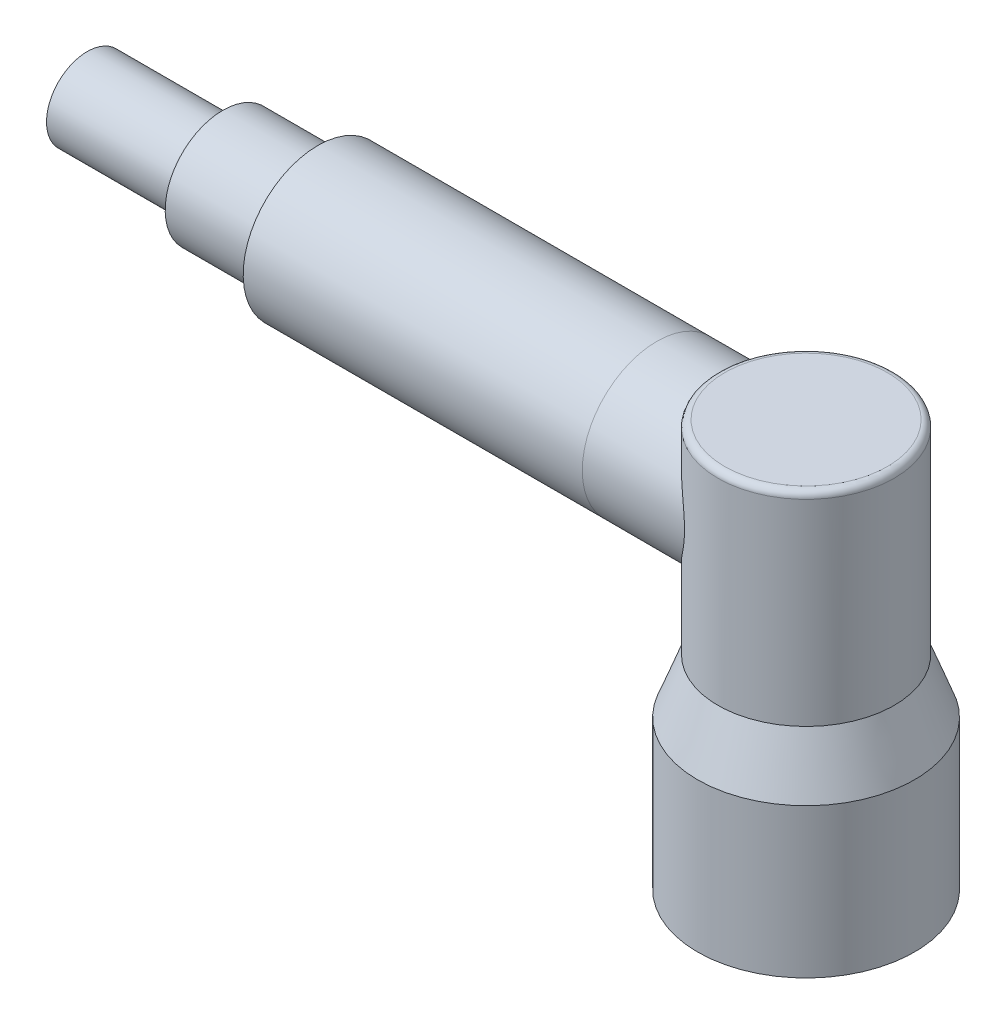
ISO-10303-21;
HEADER;
FILE_DESCRIPTION(('STEP AP214'),'2;1');
FILE_NAME('part.step','',(''),(''),'','','');
FILE_SCHEMA(('AUTOMOTIVE_DESIGN { 1 0 10303 214 1 1 1 1 }'));
ENDSEC;
DATA;
#1=APPLICATION_CONTEXT('core data for automotive mechanical design processes');
#2=APPLICATION_PROTOCOL_DEFINITION('international standard','automotive_design',2000,#1);
#3=PRODUCT_CONTEXT('',#1,'mechanical');
#4=PRODUCT('Part','Part','',(#3));
#5=PRODUCT_RELATED_PRODUCT_CATEGORY('part','',(#4));
#6=PRODUCT_DEFINITION_FORMATION('','',#4);
#7=PRODUCT_DEFINITION_CONTEXT('part definition',#1,'design');
#8=PRODUCT_DEFINITION('design','',#6,#7);
#9=PRODUCT_DEFINITION_SHAPE('','',#8);
#10=(LENGTH_UNIT() NAMED_UNIT(*) SI_UNIT(.MILLI.,.METRE.));
#11=(NAMED_UNIT(*) PLANE_ANGLE_UNIT() SI_UNIT($,.RADIAN.));
#12=(NAMED_UNIT(*) SI_UNIT($,.STERADIAN.) SOLID_ANGLE_UNIT());
#13=UNCERTAINTY_MEASURE_WITH_UNIT(LENGTH_MEASURE(1.E-05),#10,'distance_accuracy_value','');
#14=(GEOMETRIC_REPRESENTATION_CONTEXT(3) GLOBAL_UNCERTAINTY_ASSIGNED_CONTEXT((#13)) GLOBAL_UNIT_ASSIGNED_CONTEXT((#10,
#11,#12)) REPRESENTATION_CONTEXT('',''));
#15=CARTESIAN_POINT('',(0.,0.,0.));
#16=DIRECTION('',(0.,0.,1.));
#17=DIRECTION('',(1.,0.,0.));
#18=AXIS2_PLACEMENT_3D('',#15,#16,#17);
#19=CARTESIAN_POINT('',(-43.,24.,0.));
#20=DIRECTION('',(-1.,0.,0.));
#21=DIRECTION('',(0.,-1.,0.));
#22=AXIS2_PLACEMENT_3D('',#19,#20,#21);
#23=PLANE('',#22);
#24=CARTESIAN_POINT('',(-43.,24.,0.));
#25=DIRECTION('',(1.,0.,0.));
#26=DIRECTION('',(0.,1.,0.));
#27=AXIS2_PLACEMENT_3D('',#24,#25,#26);
#28=CIRCLE('',#27,4.25);
#29=CARTESIAN_POINT('',(-43.,28.25,0.));
#30=VERTEX_POINT('',#29);
#31=EDGE_CURVE('E116',#30,#30,#28,.T.);
#32=ORIENTED_EDGE('',*,*,#31,.F.);
#33=EDGE_LOOP('',(#32));
#34=FACE_BOUND('',#33,.T.);
#35=CARTESIAN_POINT('',(-43.,24.,0.));
#36=DIRECTION('',(-1.,0.,0.));
#37=DIRECTION('',(0.,-1.,0.));
#38=AXIS2_PLACEMENT_3D('',#35,#36,#37);
#39=CIRCLE('',#38,3.);
#40=CARTESIAN_POINT('',(-43.,21.,0.));
#41=VERTEX_POINT('',#40);
#42=EDGE_CURVE('E140',#41,#41,#39,.T.);
#43=ORIENTED_EDGE('',*,*,#42,.F.);
#44=EDGE_LOOP('',(#43));
#45=FACE_BOUND('',#44,.T.);
#46=ADVANCED_FACE('F38',(#34,#45),#23,.T.);
#47=CARTESIAN_POINT('',(0.,24.,0.));
#48=DIRECTION('',(1.,0.,0.));
#49=DIRECTION('',(0.,1.,0.));
#50=AXIS2_PLACEMENT_3D('',#47,#48,#49);
#51=CYLINDRICAL_SURFACE('',#50,5.5);
#52=CARTESIAN_POINT('',(-36.,24.,0.));
#53=DIRECTION('',(1.,0.,0.));
#54=DIRECTION('',(0.,1.,0.));
#55=AXIS2_PLACEMENT_3D('',#52,#53,#54);
#56=CIRCLE('',#55,5.5);
#57=CARTESIAN_POINT('',(-36.,29.5,0.));
#58=VERTEX_POINT('',#57);
#59=EDGE_CURVE('E124',#58,#58,#56,.T.);
#60=ORIENTED_EDGE('',*,*,#59,.T.);
#61=EDGE_LOOP('',(#60));
#62=FACE_BOUND('',#61,.T.);
#63=CARTESIAN_POINT('',(-11.,24.,0.));
#64=DIRECTION('',(1.,0.,0.));
#65=DIRECTION('',(0.,0.,-1.));
#66=AXIS2_PLACEMENT_3D('',#63,#64,#65);
#67=CIRCLE('',#66,5.5);
#68=CARTESIAN_POINT('',(-11.,29.5,0.));
#69=VERTEX_POINT('',#68);
#70=CARTESIAN_POINT('',(-11.,18.5,0.));
#71=VERTEX_POINT('',#70);
#72=EDGE_CURVE('E42',#69,#71,#67,.F.);
#73=ORIENTED_EDGE('',*,*,#72,.T.);
#74=EDGE_CURVE('E11',#71,#69,#67,.F.);
#75=ORIENTED_EDGE('',*,*,#74,.T.);
#76=EDGE_LOOP('',(#73,#75));
#77=FACE_BOUND('',#76,.T.);
#78=ADVANCED_FACE('F85',(#62,#77),#51,.T.);
#79=CARTESIAN_POINT('',(8.,0.,0.));
#80=DIRECTION('',(0.,-1.,0.));
#81=DIRECTION('',(0.,0.,-1.));
#82=AXIS2_PLACEMENT_3D('',#79,#80,#81);
#83=PLANE('',#82);
#84=CARTESIAN_POINT('',(0.,0.,0.));
#85=DIRECTION('',(0.,-1.,0.));
#86=DIRECTION('',(0.,0.,-1.));
#87=AXIS2_PLACEMENT_3D('',#84,#85,#86);
#88=CIRCLE('',#87,7.);
#89=CARTESIAN_POINT('',(0.,0.,-7.));
#90=VERTEX_POINT('',#89);
#91=EDGE_CURVE('E128',#90,#90,#88,.T.);
#92=ORIENTED_EDGE('',*,*,#91,.F.);
#93=EDGE_LOOP('',(#92));
#94=FACE_BOUND('',#93,.T.);
#95=CARTESIAN_POINT('',(0.,0.,0.));
#96=DIRECTION('',(0.,-1.,0.));
#97=DIRECTION('',(0.,0.,-1.));
#98=AXIS2_PLACEMENT_3D('',#95,#96,#97);
#99=CIRCLE('',#98,8.);
#100=CARTESIAN_POINT('',(0.,0.,-8.));
#101=VERTEX_POINT('',#100);
#102=EDGE_CURVE('E114',#101,#101,#99,.T.);
#103=ORIENTED_EDGE('',*,*,#102,.T.);
#104=EDGE_LOOP('',(#103));
#105=FACE_BOUND('',#104,.T.);
#106=ADVANCED_FACE('F179',(#94,#105),#83,.T.);
#107=CARTESIAN_POINT('',(0.,30.,0.));
#108=DIRECTION('',(0.,1.,0.));
#109=DIRECTION('',(0.,0.,1.));
#110=AXIS2_PLACEMENT_3D('',#107,#108,#109);
#111=PLANE('',#110);
#112=CARTESIAN_POINT('',(0.,30.,0.));
#113=DIRECTION('',(0.,1.,0.));
#114=DIRECTION('',(0.,0.,1.));
#115=AXIS2_PLACEMENT_3D('',#112,#113,#114);
#116=CIRCLE('',#115,6.);
#117=CARTESIAN_POINT('',(0.,30.,6.));
#118=VERTEX_POINT('',#117);
#119=EDGE_CURVE('E63',#118,#118,#116,.T.);
#120=ORIENTED_EDGE('',*,*,#119,.T.);
#121=EDGE_LOOP('',(#120));
#122=FACE_BOUND('',#121,.T.);
#123=ADVANCED_FACE('F107',(#122),#111,.T.);
#124=CARTESIAN_POINT('',(0.,0.,0.));
#125=DIRECTION('',(0.,-1.,0.));
#126=DIRECTION('',(0.,0.,-1.));
#127=AXIS2_PLACEMENT_3D('',#124,#125,#126);
#128=CYLINDRICAL_SURFACE('',#127,6.5);
#129=CARTESIAN_POINT('',(-6.5,29.5,0.));
#130=CARTESIAN_POINT('',(-6.4999993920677,29.4999993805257,-0.129940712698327));
#131=CARTESIAN_POINT('',(-6.49609529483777,29.4953870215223,-0.259890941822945));
#132=CARTESIAN_POINT('',(-6.48056633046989,29.4770214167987,-0.518731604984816));
#133=CARTESIAN_POINT('',(-6.46893780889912,29.4632638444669,-0.647621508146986));
#134=CARTESIAN_POINT('',(-6.43820267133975,29.4268360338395,-0.903418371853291));
#135=CARTESIAN_POINT('',(-6.41908523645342,29.4041529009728,-1.03032218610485));
#136=CARTESIAN_POINT('',(-6.3737826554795,29.3502633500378,-1.2810694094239));
#137=CARTESIAN_POINT('',(-6.34759424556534,29.3190529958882,-1.4049113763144));
#138=CARTESIAN_POINT('',(-6.28889240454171,29.2488604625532,-1.64782608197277));
#139=CARTESIAN_POINT('',(-6.25642515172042,29.2099349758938,-1.76692641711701));
#140=CARTESIAN_POINT('',(-6.185643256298,29.1247186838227,-2.00069003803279));
#141=CARTESIAN_POINT('',(-6.14732605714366,29.0784246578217,-2.11535135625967));
#142=CARTESIAN_POINT('',(-6.02456149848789,28.9293558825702,-2.45184268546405));
#143=CARTESIAN_POINT('',(-5.93224404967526,28.8163268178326,-2.66640897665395));
#144=CARTESIAN_POINT('',(-5.76331243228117,28.6063367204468,-3.00975854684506));
#145=CARTESIAN_POINT('',(-5.69079698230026,28.5153802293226,-3.14440606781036));
#146=CARTESIAN_POINT('',(-5.5399558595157,28.3237265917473,-3.40312710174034));
#147=CARTESIAN_POINT('',(-5.46163020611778,28.223029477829,-3.52720065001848));
#148=CARTESIAN_POINT('',(-5.30055187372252,28.0125374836,-3.76494835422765));
#149=CARTESIAN_POINT('',(-5.21778791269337,27.9027189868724,-3.87859380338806));
#150=CARTESIAN_POINT('',(-5.04962413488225,27.6748630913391,-4.09512865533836));
#151=CARTESIAN_POINT('',(-4.96422466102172,27.5568267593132,-4.19801944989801));
#152=CARTESIAN_POINT('',(-4.79079104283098,27.3105114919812,-4.39498205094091));
#153=CARTESIAN_POINT('',(-4.70273792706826,27.1820782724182,-4.48884404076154));
#154=CARTESIAN_POINT('',(-4.52761122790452,26.9170483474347,-4.6654256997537));
#155=CARTESIAN_POINT('',(-4.44053798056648,26.7804489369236,-4.74814164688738));
#156=CARTESIAN_POINT('',(-4.27006163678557,26.499186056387,-4.90201143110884));
#157=CARTESIAN_POINT('',(-4.1866507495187,26.3545413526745,-4.97319077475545));
#158=CARTESIAN_POINT('',(-4.02659319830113,26.0565102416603,-5.10364522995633));
#159=CARTESIAN_POINT('',(-3.94994093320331,25.9031312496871,-5.16293025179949));
#160=CARTESIAN_POINT('',(-3.80248138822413,25.5753981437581,-5.27258537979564));
#161=CARTESIAN_POINT('',(-3.73251141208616,25.4003303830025,-5.32198656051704));
#162=CARTESIAN_POINT('',(-3.61279207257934,25.0396459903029,-5.40398734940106));
#163=CARTESIAN_POINT('',(-3.56299681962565,24.8540544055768,-5.43662513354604));
#164=CARTESIAN_POINT('',(-3.50918500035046,24.5686304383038,-5.47138637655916));
#165=CARTESIAN_POINT('',(-3.49470068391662,24.4715811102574,-5.48062159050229));
#166=CARTESIAN_POINT('',(-3.47374612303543,24.2762496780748,-5.49392847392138));
#167=CARTESIAN_POINT('',(-3.46727493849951,24.1779677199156,-5.49800074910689));
#168=CARTESIAN_POINT('',(-3.46275592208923,23.9811791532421,-5.50084793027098));
#169=CARTESIAN_POINT('',(-3.46470415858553,23.8826726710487,-5.49962530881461));
#170=CARTESIAN_POINT('',(-3.47688890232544,23.6863816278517,-5.49192989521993));
#171=CARTESIAN_POINT('',(-3.48712625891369,23.5885971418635,-5.48545656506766));
#172=CARTESIAN_POINT('',(-3.51593822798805,23.3901623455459,-5.46703575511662));
#173=CARTESIAN_POINT('',(-3.53487498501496,23.2895873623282,-5.45484996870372));
#174=CARTESIAN_POINT('',(-3.58010541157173,23.0908614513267,-5.42527199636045));
#175=CARTESIAN_POINT('',(-3.60640408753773,22.9927122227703,-5.40787626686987));
#176=CARTESIAN_POINT('',(-3.69464274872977,22.7021012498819,-5.34832845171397));
#177=CARTESIAN_POINT('',(-3.76585272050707,22.5139120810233,-5.29885876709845));
#178=CARTESIAN_POINT('',(-3.90868928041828,22.1846422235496,-5.19407887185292));
#179=CARTESIAN_POINT('',(-3.97767056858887,22.0414005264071,-5.14166014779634));
#180=CARTESIAN_POINT('',(-4.12219061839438,21.7624403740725,-5.02653776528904));
#181=CARTESIAN_POINT('',(-4.19773353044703,21.6267267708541,-4.96382757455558));
#182=CARTESIAN_POINT('',(-4.35266497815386,21.3623536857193,-4.8285513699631));
#183=CARTESIAN_POINT('',(-4.43205875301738,21.2337043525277,-4.75597167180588));
#184=CARTESIAN_POINT('',(-4.59245977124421,20.9833954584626,-4.60127500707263));
#185=CARTESIAN_POINT('',(-4.67346666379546,20.8617343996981,-4.51916009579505));
#186=CARTESIAN_POINT('',(-4.84071870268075,20.6175482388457,-4.33975279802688));
#187=CARTESIAN_POINT('',(-4.92695861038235,20.4954907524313,-4.24181792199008));
#188=CARTESIAN_POINT('',(-5.09758028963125,20.2594157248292,-4.03517548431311));
#189=CARTESIAN_POINT('',(-5.18196179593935,20.1453993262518,-3.92646639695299));
#190=CARTESIAN_POINT('',(-5.34708488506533,19.9261188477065,-3.69843859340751));
#191=CARTESIAN_POINT('',(-5.42783274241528,19.8208393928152,-3.5791393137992));
#192=CARTESIAN_POINT('',(-5.58424296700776,19.6196155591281,-3.32985399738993));
#193=CARTESIAN_POINT('',(-5.65990511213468,19.5236715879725,-3.199867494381));
#194=CARTESIAN_POINT('',(-5.84664097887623,19.2892916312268,-2.85052138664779));
#195=CARTESIAN_POINT('',(-5.95276771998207,19.158529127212,-2.62309150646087));
#196=CARTESIAN_POINT('',(-6.09433822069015,18.9858178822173,-2.26399630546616));
#197=CARTESIAN_POINT('',(-6.13860329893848,18.9321392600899,-2.14126338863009));
#198=CARTESIAN_POINT('',(-6.22046651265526,18.8332817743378,-1.89028636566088));
#199=CARTESIAN_POINT('',(-6.25806756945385,18.7880991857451,-1.76204470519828));
#200=CARTESIAN_POINT('',(-6.3261279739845,18.7065699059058,-1.49955369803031));
#201=CARTESIAN_POINT('',(-6.35651844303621,18.6703083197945,-1.36525993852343));
#202=CARTESIAN_POINT('',(-6.40898986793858,18.6078353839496,-1.09274688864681));
#203=CARTESIAN_POINT('',(-6.43107077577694,18.5816240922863,-0.954527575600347));
#204=CARTESIAN_POINT('',(-6.46633536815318,18.5398151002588,-0.675476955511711));
#205=CARTESIAN_POINT('',(-6.47952598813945,18.5242091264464,-0.534647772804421));
#206=CARTESIAN_POINT('',(-6.49667266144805,18.5039299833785,-0.251652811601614));
#207=CARTESIAN_POINT('',(-6.50063005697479,18.4992552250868,-0.109487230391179));
#208=CARTESIAN_POINT('',(-6.49930482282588,18.5008217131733,0.155048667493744));
#209=CARTESIAN_POINT('',(-6.49522453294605,18.5056425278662,0.277437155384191));
#210=CARTESIAN_POINT('',(-6.4802180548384,18.5233907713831,0.521242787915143));
#211=CARTESIAN_POINT('',(-6.46928965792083,18.5363208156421,0.642659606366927));
#212=CARTESIAN_POINT('',(-6.44080985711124,18.5700723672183,0.883554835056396));
#213=CARTESIAN_POINT('',(-6.42326096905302,18.5908908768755,1.00303396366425));
#214=CARTESIAN_POINT('',(-6.38188572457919,18.6400895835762,1.23933491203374));
#215=CARTESIAN_POINT('',(-6.3580569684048,18.6684726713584,1.35615569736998));
#216=CARTESIAN_POINT('',(-6.27839849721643,18.7636363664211,1.69886877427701));
#217=CARTESIAN_POINT('',(-6.2140274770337,18.8408641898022,1.91999215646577));
#218=CARTESIAN_POINT('',(-6.06635918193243,19.0197129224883,2.34522807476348));
#219=CARTESIAN_POINT('',(-5.98305423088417,19.1213437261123,2.549333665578));
#220=CARTESIAN_POINT('',(-5.82729154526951,19.3138971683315,2.88383762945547));
#221=CARTESIAN_POINT('',(-5.75835878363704,19.3998101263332,3.01883682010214));
#222=CARTESIAN_POINT('',(-5.61443917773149,19.5812911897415,3.27873942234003));
#223=CARTESIAN_POINT('',(-5.53945209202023,19.6768596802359,3.40364243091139));
#224=CARTESIAN_POINT('',(-5.38474190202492,19.8769568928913,3.64348363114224));
#225=CARTESIAN_POINT('',(-5.3050077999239,19.9815066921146,3.75839703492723));
#226=CARTESIAN_POINT('',(-5.14246202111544,20.1986706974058,3.97790533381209));
#227=CARTESIAN_POINT('',(-5.05965072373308,20.3112839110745,4.0825014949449));
#228=CARTESIAN_POINT('',(-4.89093081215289,20.5463022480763,4.28325804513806));
#229=CARTESIAN_POINT('',(-4.80499324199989,20.6688496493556,4.37922729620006));
#230=CARTESIAN_POINT('',(-4.6332635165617,20.9217283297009,4.56053273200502));
#231=CARTESIAN_POINT('',(-4.54747140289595,21.0520615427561,4.64586625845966));
#232=CARTESIAN_POINT('',(-4.37829066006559,21.3203965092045,4.8056294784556));
#233=CARTESIAN_POINT('',(-4.2948984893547,21.4583859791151,4.88007597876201));
#234=CARTESIAN_POINT('',(-4.13311144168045,21.7425150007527,5.01783534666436));
#235=CARTESIAN_POINT('',(-4.05471355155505,21.8886495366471,5.08115496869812));
#236=CARTESIAN_POINT('',(-3.89502086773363,22.2127994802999,5.2048509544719));
#237=CARTESIAN_POINT('',(-3.8151222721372,22.3922692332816,5.26329029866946));
#238=CARTESIAN_POINT('',(-3.67433685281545,22.7630868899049,5.36252740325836));
#239=CARTESIAN_POINT('',(-3.61340975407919,22.9544085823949,5.40336260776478));
#240=CARTESIAN_POINT('',(-3.5272781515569,23.3163231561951,5.45990724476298));
#241=CARTESIAN_POINT('',(-3.49795922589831,23.4854360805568,5.47856063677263));
#242=CARTESIAN_POINT('',(-3.46427144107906,23.8270639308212,5.4999339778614));
#243=CARTESIAN_POINT('',(-3.45987042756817,23.9995741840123,5.50267446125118));
#244=CARTESIAN_POINT('',(-3.47677765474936,24.3426049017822,5.49200213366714));
#245=CARTESIAN_POINT('',(-3.49806647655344,24.5131267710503,5.47860152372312));
#246=CARTESIAN_POINT('',(-3.56261013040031,24.8481795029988,5.43683917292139));
#247=CARTESIAN_POINT('',(-3.60590551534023,25.0126987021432,5.40844980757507));
#248=CARTESIAN_POINT('',(-3.69802536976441,25.2999584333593,5.34574788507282));
#249=CARTESIAN_POINT('',(-3.74381931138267,25.4242628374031,5.3139011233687));
#250=CARTESIAN_POINT('',(-3.84299258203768,25.6676159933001,5.24262696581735));
#251=CARTESIAN_POINT('',(-3.89637660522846,25.7866614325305,5.20319487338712));
#252=CARTESIAN_POINT('',(-4.0086856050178,26.0199129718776,5.11717292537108));
#253=CARTESIAN_POINT('',(-4.06762793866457,26.1341021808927,5.07056033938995));
#254=CARTESIAN_POINT('',(-4.18913862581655,26.3574670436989,4.97064506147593));
#255=CARTESIAN_POINT('',(-4.25170666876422,26.4666431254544,4.91734294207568));
#256=CARTESIAN_POINT('',(-4.40816197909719,26.7290172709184,4.77843814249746));
#257=CARTESIAN_POINT('',(-4.50330499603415,26.8795539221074,4.68919976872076));
#258=CARTESIAN_POINT('',(-4.69497744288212,27.1709336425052,4.4972903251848));
#259=CARTESIAN_POINT('',(-4.79150746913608,27.311772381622,4.39461331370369));
#260=CARTESIAN_POINT('',(-4.98317305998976,27.5834708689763,4.17601213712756));
#261=CARTESIAN_POINT('',(-5.07831018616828,27.7143426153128,4.06010433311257));
#262=CARTESIAN_POINT('',(-5.26492227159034,27.9656611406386,3.81501739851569));
#263=CARTESIAN_POINT('',(-5.35639872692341,28.0861122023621,3.68584376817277));
#264=CARTESIAN_POINT('',(-5.58142679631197,28.3777886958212,3.34064219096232));
#265=CARTESIAN_POINT('',(-5.71108451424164,28.541392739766,3.11532424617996));
#266=CARTESIAN_POINT('',(-5.88893642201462,28.7625039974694,2.75471455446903));
#267=CARTESIAN_POINT('',(-5.9454423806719,28.8321519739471,2.63075481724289));
#268=CARTESIAN_POINT('',(-6.05193197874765,28.962591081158,2.37554206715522));
#269=CARTESIAN_POINT('',(-6.10191695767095,29.0233840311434,2.24429056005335));
#270=CARTESIAN_POINT('',(-6.18642031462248,29.1256682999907,1.99803767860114));
#271=CARTESIAN_POINT('',(-6.22212315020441,29.1686837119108,1.88407246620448));
#272=CARTESIAN_POINT('',(-6.28770960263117,29.2474535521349,1.65203902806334));
#273=CARTESIAN_POINT('',(-6.31759440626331,29.2832094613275,1.53397164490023));
#274=CARTESIAN_POINT('',(-6.37095779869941,29.3469061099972,1.29456914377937));
#275=CARTESIAN_POINT('',(-6.39444816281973,29.3748612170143,1.17324049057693));
#276=CARTESIAN_POINT('',(-6.43462522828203,29.4225979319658,0.927920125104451));
#277=CARTESIAN_POINT('',(-6.45131484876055,29.4423830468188,0.803929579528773));
#278=CARTESIAN_POINT('',(-6.47621802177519,29.471878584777,0.566857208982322));
#279=CARTESIAN_POINT('',(-6.4851212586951,29.4824093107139,0.453949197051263));
#280=CARTESIAN_POINT('',(-6.49701312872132,29.4964710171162,0.227363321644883));
#281=CARTESIAN_POINT('',(-6.50000053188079,29.5000005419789,0.113685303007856));
#282=CARTESIAN_POINT('',(-6.5,29.5,0.));
#283=B_SPLINE_CURVE_WITH_KNOTS('',3,(#129,#130,#131,#132,#133,#134,#135,#136,#137,#138,#139,
#140,#141,#142,#143,#144,#145,#146,#147,#148,#149,#150,#151,#152,#153,#154,#155,#156,#157,#158,
#159,#160,#161,#162,#163,#164,#165,#166,#167,#168,#169,#170,#171,#172,#173,#174,#175,#176,#177,
#178,#179,#180,#181,#182,#183,#184,#185,#186,#187,#188,#189,#190,#191,#192,#193,#194,#195,#196,
#197,#198,#199,#200,#201,#202,#203,#204,#205,#206,#207,#208,#209,#210,#211,#212,#213,#214,#215,
#216,#217,#218,#219,#220,#221,#222,#223,#224,#225,#226,#227,#228,#229,#230,#231,#232,#233,#234,
#235,#236,#237,#238,#239,#240,#241,#242,#243,#244,#245,#246,#247,#248,#249,#250,#251,#252,#253,
#254,#255,#256,#257,#258,#259,#260,#261,#262,#263,#264,#265,#266,#267,#268,#269,#270,#271,#272,
#273,#274,#275,#276,#277,#278,#279,#280,#281,#282),.UNSPECIFIED.,.T.,.F.,(4,2,2,2,2,2,2,2,2,2,2,
2,2,2,2,2,2,2,2,2,2,2,2,2,2,2,2,2,2,2,2,2,2,2,2,2,2,2,2,2,2,2,2,2,2,2,2,2,2,2,2,2,2,2,2,2,2,2,2,
2,2,2,2,2,2,2,2,2,2,2,2,2,2,2,2,2,4),(0.,0.389699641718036,0.779583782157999,1.17003326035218,
1.56066327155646,1.9485226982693,2.33655211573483,3.11188253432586,3.64509549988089,
4.1783066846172,4.71294423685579,5.24751251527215,5.79245159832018,6.33757220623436,
6.88147064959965,7.42491402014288,8.00809697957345,8.58994587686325,8.88521583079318,
9.18045114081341,9.47554859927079,9.77067629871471,10.0793915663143,10.3883172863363,
11.0074836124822,11.5091106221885,12.0110572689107,12.5137071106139,13.0162488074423,
13.5517820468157,14.0873912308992,14.6220369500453,15.1567060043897,16.001819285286,
16.4246507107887,16.8472963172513,17.2738298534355,17.7003658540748,18.1265687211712,
18.5527096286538,18.9199080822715,19.2872250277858,19.6544025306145,20.0217205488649,
20.7473618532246,21.4732978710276,21.9953427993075,22.5174085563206,23.0407348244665,
23.5639967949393,24.0969084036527,24.6299529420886,25.1621657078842,25.694054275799,
26.3074278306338,26.9194902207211,27.4351718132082,27.9501878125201,28.4648147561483,
28.9803934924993,29.3885710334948,29.7970021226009,30.2067537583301,30.6164703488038,
31.2132667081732,31.8103278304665,32.4066584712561,33.0027428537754,33.9200806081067,
34.3786435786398,34.8371122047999,35.2175521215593,35.5979143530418,35.9775713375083,
36.3570651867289,36.6979430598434,37.0388917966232),.UNSPECIFIED.);
#284=CARTESIAN_POINT('',(-6.5,29.5,0.));
#285=VERTEX_POINT('',#284);
#286=EDGE_CURVE('E64',#285,#285,#283,.T.);
#287=ORIENTED_EDGE('',*,*,#286,.F.);
#288=CARTESIAN_POINT('',(0.,29.5,0.));
#289=DIRECTION('',(0.,1.,0.));
#290=DIRECTION('',(0.,0.,1.));
#291=AXIS2_PLACEMENT_3D('',#288,#289,#290);
#292=CIRCLE('',#291,6.5);
#293=EDGE_CURVE('E59',#285,#285,#292,.F.);
#294=ORIENTED_EDGE('',*,*,#293,.T.);
#295=EDGE_LOOP('',(#287,#294));
#296=FACE_BOUND('',#295,.T.);
#297=CARTESIAN_POINT('',(0.,15.,0.));
#298=DIRECTION('',(0.,-1.,0.));
#299=DIRECTION('',(0.,0.,-1.));
#300=AXIS2_PLACEMENT_3D('',#297,#298,#299);
#301=CIRCLE('',#300,6.5);
#302=CARTESIAN_POINT('',(0.,15.,-6.5));
#303=VERTEX_POINT('',#302);
#304=EDGE_CURVE('E67',#303,#303,#301,.T.);
#305=ORIENTED_EDGE('',*,*,#304,.F.);
#306=EDGE_LOOP('',(#305));
#307=FACE_BOUND('',#306,.T.);
#308=ADVANCED_FACE('F75',(#296,#307),#128,.T.);
#309=CARTESIAN_POINT('',(0.,11.,0.));
#310=DIRECTION('',(0.,-1.,0.));
#311=DIRECTION('',(0.,0.,-1.));
#312=AXIS2_PLACEMENT_3D('',#309,#310,#311);
#313=CONICAL_SURFACE('',#312,8.,0.358770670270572);
#314=ORIENTED_EDGE('',*,*,#304,.T.);
#315=EDGE_LOOP('',(#314));
#316=FACE_BOUND('',#315,.T.);
#317=CARTESIAN_POINT('',(0.,11.,0.));
#318=DIRECTION('',(0.,-1.,0.));
#319=DIRECTION('',(0.,0.,-1.));
#320=AXIS2_PLACEMENT_3D('',#317,#318,#319);
#321=CIRCLE('',#320,8.);
#322=CARTESIAN_POINT('',(0.,11.,-8.));
#323=VERTEX_POINT('',#322);
#324=EDGE_CURVE('E113',#323,#323,#321,.T.);
#325=ORIENTED_EDGE('',*,*,#324,.F.);
#326=EDGE_LOOP('',(#325));
#327=FACE_BOUND('',#326,.T.);
#328=ADVANCED_FACE('F100',(#316,#327),#313,.T.);
#329=CARTESIAN_POINT('',(0.,0.,0.));
#330=DIRECTION('',(0.,-1.,0.));
#331=DIRECTION('',(0.,0.,-1.));
#332=AXIS2_PLACEMENT_3D('',#329,#330,#331);
#333=CYLINDRICAL_SURFACE('',#332,8.);
#334=ORIENTED_EDGE('',*,*,#324,.T.);
#335=EDGE_LOOP('',(#334));
#336=FACE_BOUND('',#335,.T.);
#337=ORIENTED_EDGE('',*,*,#102,.F.);
#338=EDGE_LOOP('',(#337));
#339=FACE_BOUND('',#338,.T.);
#340=ADVANCED_FACE('F94',(#336,#339),#333,.T.);
#341=CARTESIAN_POINT('',(0.,24.,0.));
#342=DIRECTION('',(1.,0.,0.));
#343=DIRECTION('',(0.,1.,0.));
#344=AXIS2_PLACEMENT_3D('',#341,#342,#343);
#345=CYLINDRICAL_SURFACE('',#344,4.25);
#346=ORIENTED_EDGE('',*,*,#31,.T.);
#347=EDGE_LOOP('',(#346));
#348=FACE_BOUND('',#347,.T.);
#349=CARTESIAN_POINT('',(-36.,24.,0.));
#350=DIRECTION('',(1.,0.,0.));
#351=DIRECTION('',(0.,1.,0.));
#352=AXIS2_PLACEMENT_3D('',#349,#350,#351);
#353=CIRCLE('',#352,4.25);
#354=CARTESIAN_POINT('',(-36.,28.25,0.));
#355=VERTEX_POINT('',#354);
#356=EDGE_CURVE('E121',#355,#355,#353,.T.);
#357=ORIENTED_EDGE('',*,*,#356,.F.);
#358=EDGE_LOOP('',(#357));
#359=FACE_BOUND('',#358,.T.);
#360=ADVANCED_FACE('F90',(#348,#359),#345,.T.);
#361=CARTESIAN_POINT('',(-36.,28.25,0.));
#362=DIRECTION('',(-1.,0.,0.));
#363=DIRECTION('',(0.,-1.,0.));
#364=AXIS2_PLACEMENT_3D('',#361,#362,#363);
#365=PLANE('',#364);
#366=ORIENTED_EDGE('',*,*,#356,.T.);
#367=EDGE_LOOP('',(#366));
#368=FACE_BOUND('',#367,.T.);
#369=ORIENTED_EDGE('',*,*,#59,.F.);
#370=EDGE_LOOP('',(#369));
#371=FACE_BOUND('',#370,.T.);
#372=ADVANCED_FACE('F84',(#368,#371),#365,.T.);
#373=ORIENTED_EDGE('',*,*,#74,.F.);
#374=ORIENTED_EDGE('',*,*,#72,.F.);
#375=EDGE_LOOP('',(#373,#374));
#376=FACE_BOUND('',#375,.T.);
#377=ORIENTED_EDGE('',*,*,#286,.T.);
#378=EDGE_LOOP('',(#377));
#379=FACE_BOUND('',#378,.T.);
#380=ADVANCED_FACE('F79',(#376,#379),#51,.T.);
#381=CARTESIAN_POINT('',(0.,29.5,0.));
#382=DIRECTION('',(0.,1.,0.));
#383=DIRECTION('',(0.,0.,1.));
#384=AXIS2_PLACEMENT_3D('',#381,#382,#383);
#385=TOROIDAL_SURFACE('',#384,6.,0.5);
#386=ORIENTED_EDGE('',*,*,#119,.F.);
#387=EDGE_LOOP('',(#386));
#388=FACE_BOUND('',#387,.T.);
#389=ORIENTED_EDGE('',*,*,#293,.F.);
#390=EDGE_LOOP('',(#389));
#391=FACE_BOUND('',#390,.T.);
#392=ADVANCED_FACE('F40',(#388,#391),#385,.T.);
#393=CARTESIAN_POINT('',(0.,10.,0.));
#394=DIRECTION('',(0.,-1.,0.));
#395=DIRECTION('',(0.,0.,-1.));
#396=AXIS2_PLACEMENT_3D('',#393,#394,#395);
#397=CYLINDRICAL_SURFACE('',#396,7.);
#398=CARTESIAN_POINT('',(0.,10.,0.));
#399=DIRECTION('',(0.,-1.,0.));
#400=DIRECTION('',(0.,0.,-1.));
#401=AXIS2_PLACEMENT_3D('',#398,#399,#400);
#402=CIRCLE('',#401,7.);
#403=CARTESIAN_POINT('',(0.,10.,-7.));
#404=VERTEX_POINT('',#403);
#405=EDGE_CURVE('E127',#404,#404,#402,.T.);
#406=ORIENTED_EDGE('',*,*,#405,.F.);
#407=EDGE_LOOP('',(#406));
#408=FACE_BOUND('',#407,.T.);
#409=ORIENTED_EDGE('',*,*,#91,.T.);
#410=EDGE_LOOP('',(#409));
#411=FACE_BOUND('',#410,.T.);
#412=ADVANCED_FACE('F86',(#408,#411),#397,.F.);
#413=CARTESIAN_POINT('',(0.,10.,0.));
#414=DIRECTION('',(0.,-1.,0.));
#415=DIRECTION('',(0.,0.,-1.));
#416=AXIS2_PLACEMENT_3D('',#413,#414,#415);
#417=PLANE('',#416);
#418=CARTESIAN_POINT('',(0.,10.,0.));
#419=DIRECTION('',(0.,-1.,0.));
#420=DIRECTION('',(0.,0.,-1.));
#421=AXIS2_PLACEMENT_3D('',#418,#419,#420);
#422=CIRCLE('',#421,3.5);
#423=CARTESIAN_POINT('',(0.,10.,-3.5));
#424=VERTEX_POINT('',#423);
#425=EDGE_CURVE('E134',#424,#424,#422,.T.);
#426=ORIENTED_EDGE('',*,*,#425,.F.);
#427=EDGE_LOOP('',(#426));
#428=FACE_BOUND('',#427,.T.);
#429=ORIENTED_EDGE('',*,*,#405,.T.);
#430=EDGE_LOOP('',(#429));
#431=FACE_BOUND('',#430,.T.);
#432=ADVANCED_FACE('F165',(#428,#431),#417,.T.);
#433=CARTESIAN_POINT('',(0.,19.,0.));
#434=DIRECTION('',(0.,-1.,0.));
#435=DIRECTION('',(0.,0.,-1.));
#436=AXIS2_PLACEMENT_3D('',#433,#434,#435);
#437=CYLINDRICAL_SURFACE('',#436,3.5);
#438=CARTESIAN_POINT('',(0.,19.,0.));
#439=DIRECTION('',(0.,-1.,0.));
#440=DIRECTION('',(0.,0.,-1.));
#441=AXIS2_PLACEMENT_3D('',#438,#439,#440);
#442=CIRCLE('',#441,3.5);
#443=CARTESIAN_POINT('',(0.,19.,-3.5));
#444=VERTEX_POINT('',#443);
#445=EDGE_CURVE('E131',#444,#444,#442,.T.);
#446=ORIENTED_EDGE('',*,*,#445,.F.);
#447=EDGE_LOOP('',(#446));
#448=FACE_BOUND('',#447,.T.);
#449=ORIENTED_EDGE('',*,*,#425,.T.);
#450=EDGE_LOOP('',(#449));
#451=FACE_BOUND('',#450,.T.);
#452=ADVANCED_FACE('F160',(#448,#451),#437,.F.);
#453=CARTESIAN_POINT('',(0.,19.,0.));
#454=DIRECTION('',(0.,-1.,0.));
#455=DIRECTION('',(0.,0.,-1.));
#456=AXIS2_PLACEMENT_3D('',#453,#454,#455);
#457=PLANE('',#456);
#458=ORIENTED_EDGE('',*,*,#445,.T.);
#459=EDGE_LOOP('',(#458));
#460=FACE_BOUND('',#459,.T.);
#461=ADVANCED_FACE('F151',(#460),#457,.T.);
#462=CARTESIAN_POINT('',(-53.,24.,0.));
#463=DIRECTION('',(1.,0.,0.));
#464=DIRECTION('',(0.,1.,0.));
#465=AXIS2_PLACEMENT_3D('',#462,#463,#464);
#466=CYLINDRICAL_SURFACE('',#465,3.);
#467=CARTESIAN_POINT('',(-53.,24.,0.));
#468=DIRECTION('',(-1.,0.,0.));
#469=DIRECTION('',(0.,-1.,0.));
#470=AXIS2_PLACEMENT_3D('',#467,#468,#469);
#471=CIRCLE('',#470,3.);
#472=CARTESIAN_POINT('',(-53.,21.,0.));
#473=VERTEX_POINT('',#472);
#474=EDGE_CURVE('E137',#473,#473,#471,.T.);
#475=ORIENTED_EDGE('',*,*,#474,.F.);
#476=EDGE_LOOP('',(#475));
#477=FACE_BOUND('',#476,.T.);
#478=ORIENTED_EDGE('',*,*,#42,.T.);
#479=EDGE_LOOP('',(#478));
#480=FACE_BOUND('',#479,.T.);
#481=ADVANCED_FACE('F148',(#477,#480),#466,.T.);
#482=CARTESIAN_POINT('',(-53.,24.,0.));
#483=DIRECTION('',(-1.,0.,0.));
#484=DIRECTION('',(0.,-1.,0.));
#485=AXIS2_PLACEMENT_3D('',#482,#483,#484);
#486=PLANE('',#485);
#487=ORIENTED_EDGE('',*,*,#474,.T.);
#488=EDGE_LOOP('',(#487));
#489=FACE_BOUND('',#488,.T.);
#490=ADVANCED_FACE('F146',(#489),#486,.T.);
#491=CLOSED_SHELL('',(#46,#78,#106,#123,#308,#328,#340,#360,#372,#380,#392,#412,#432,#452,#461,
#481,#490));
#492=MANIFOLD_SOLID_BREP('B2',#491);
#493=ADVANCED_BREP_SHAPE_REPRESENTATION('',(#18,#492),#14);
#494=SHAPE_DEFINITION_REPRESENTATION(#9,#493);
ENDSEC;
END-ISO-10303-21;
